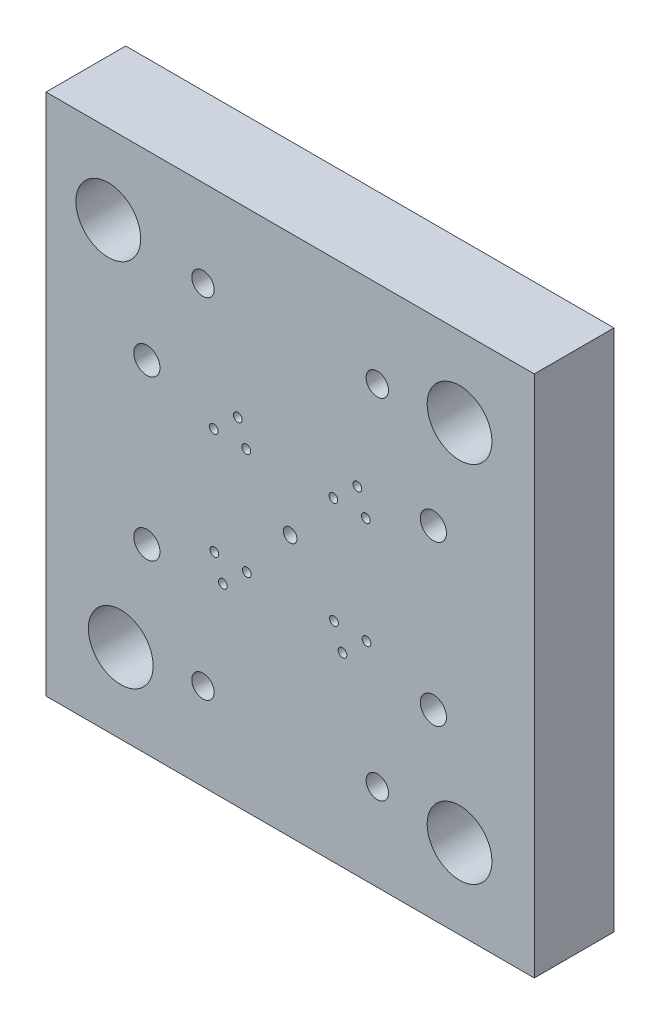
from build123d import *

# Parameters (mm, degrees)
ESQUISSE1_W              = 196
ESQUISSE1_H              = 210
EXTRUSION1_DEPTH         = 32
ESQUISSE3_R              = 13
ENL_V_MAT_EXTRU_1_DEPTH  = 290.032870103
ESQUISSE17_R             = 5.25
ESQUISSE17_R_2           = 2.75
ENL_V_MAT_EXTRU_9_DEPTH  = 290.032870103
ESQUISSE19_R             = 1.75
ENL_V_MAT_EXTRU_10_DEPTH = 290.032870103
ESQUISSE20_R             = 4.5
ENL_V_MAT_EXTRU_11_DEPTH = 290.032870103


with BuildPart() as part:
    # Esquisse1 → Extrusion1 (new body)
    with BuildSketch(Plane.XY):
        with Locations((98, 105)):
            Rectangle(ESQUISSE1_W, ESQUISSE1_H)
    extrude(amount=EXTRUSION1_DEPTH)

    # Esquisse3 → Enl_v. mat.-Extru.1 (cut, through all)
    with BuildSketch(Plane(origin=(0, 0, 0), x_dir=(-1, 0, 0), z_dir=(0, 0, -1))):
        with Locations((-25, 178)):
            Circle(ESQUISSE3_R)
        with Locations((-30, 32)):
            Circle(ESQUISSE3_R)
        with Locations((-166, 32)):
            Circle(ESQUISSE3_R)
        with Locations((-166, 178)):
            Circle(ESQUISSE3_R)
    extrude(amount=-ENL_V_MAT_EXTRU_1_DEPTH, mode=Mode.SUBTRACT)

    # Esquisse17 → Enl_v. mat.-Extru.9 (cut, through all)
    with BuildSketch(Plane(origin=(0, 0, 0), x_dir=(-1, 0, 0), z_dir=(0, 0, -1))):
        with Locations((-40.5, 137)):
            Circle(ESQUISSE17_R)
        with Locations((-40.5, 73)):
            Circle(ESQUISSE17_R)
        with Locations((-155.5, 73)):
            Circle(ESQUISSE17_R)
        with Locations((-155.5, 137)):
            Circle(ESQUISSE17_R)
        with Locations((-98, 105)):
            Circle(ESQUISSE17_R_2)
    extrude(amount=-ENL_V_MAT_EXTRU_9_DEPTH, mode=Mode.SUBTRACT)

    # Esquisse19 → Enl_v. mat.-Extru.10 (cut, through all)
    with BuildSketch(Plane(origin=(0, 0, 0), x_dir=(-1, 0, 0), z_dir=(0, 0, -1))):
        with Locations((-67.36, 126.58)):
            Circle(ESQUISSE19_R)
        with Locations((-80.41, 126.07)):
            Circle(ESQUISSE19_R)
        with Locations((-76.99, 135.41)):
            Circle(ESQUISSE19_R)
        with Locations((-67.59, 83.93)):
            Circle(ESQUISSE19_R)
        with Locations((-71.01, 74.59)):
            Circle(ESQUISSE19_R)
        with Locations((-80.64, 83.42)):
            Circle(ESQUISSE19_R)
        with Locations((-128.64, 83.42)):
            Circle(ESQUISSE19_R)
        with Locations((-115.59, 83.93)):
            Circle(ESQUISSE19_R)
        with Locations((-119.01, 74.59)):
            Circle(ESQUISSE19_R)
        with Locations((-124.99, 135.41)):
            Circle(ESQUISSE19_R)
        with Locations((-128.41, 126.07)):
            Circle(ESQUISSE19_R)
        with Locations((-115.36, 126.58)):
            Circle(ESQUISSE19_R)
    extrude(amount=-ENL_V_MAT_EXTRU_10_DEPTH, mode=Mode.SUBTRACT)

    # Esquisse20 → Enl_v. mat.-Extru.11 (cut, through all)
    with BuildSketch(Plane(origin=(0, 0, 0), x_dir=(-1, 0, 0), z_dir=(0, 0, -1))):
        with Locations((-63, 35)):
            Circle(ESQUISSE20_R)
        with Locations(Location((-63, 175, 0), (0, 0, 180))):
            Circle(ESQUISSE20_R)
        with Locations((-133, 175)):
            Circle(ESQUISSE20_R)
        with Locations(Location((-133, 35, 0), (0, 0, 180))):
            Circle(ESQUISSE20_R)
    extrude(amount=-ENL_V_MAT_EXTRU_11_DEPTH, mode=Mode.SUBTRACT)


solid = part.part
